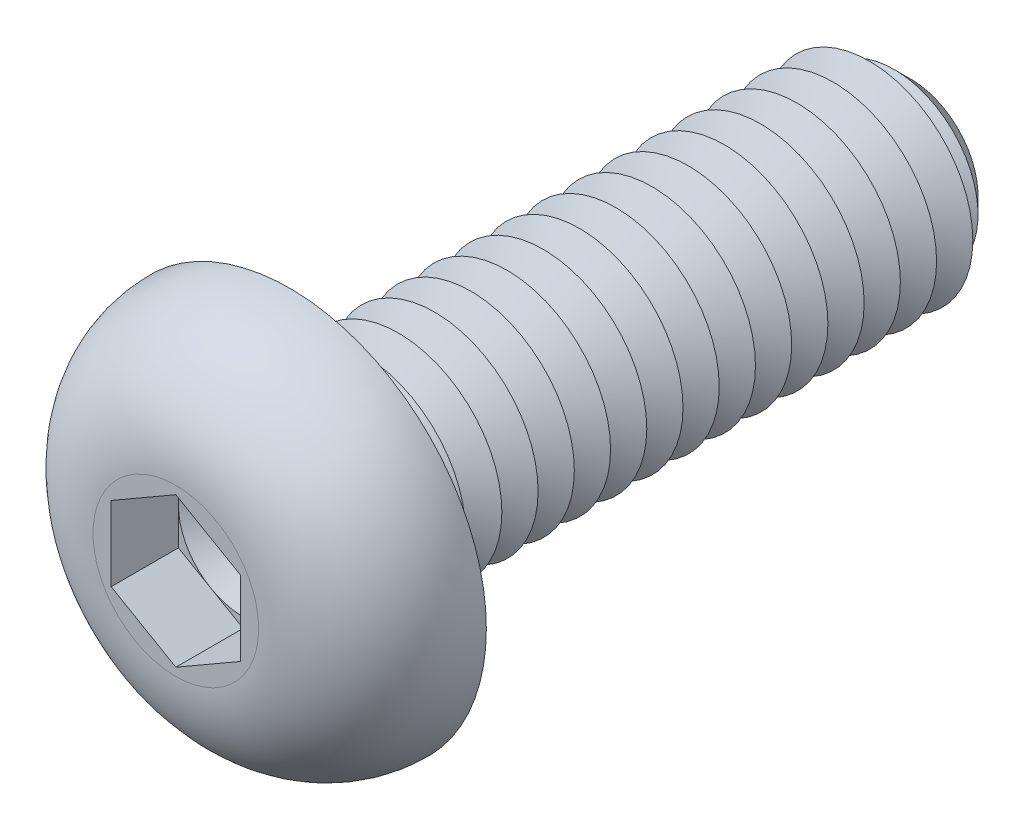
from build123d import *

# Parameters (mm, degrees)
CUT_EXTRUDE1_DEPTH  = 1.3
SKETCH4_R           = 2
BOSS_EXTRUDE1_DEPTH = 12
CHAMFER1_SIZE       = 0.7
LPATTERN1_COUNT     = 16
LPATTERN1_PITCH     = 0.7
FILLET2_R           = 0.3


with BuildPart() as part:
    # Sketch2 → Revolve1 (revolve)
    with BuildSketch(Plane(origin=(0, 0, 0), x_dir=(0, 0, -1), z_dir=(1, 0, 0)), mode=Mode.PRIVATE) as revolve1_sk:
        with BuildLine():
            Line((0, 0), (-2.2, 0))
            Line((-2.2, 0), (-2.2, 1.6))
            ThreePointArc((-2.2, 1.6), (-1.555634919, 3.155634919), (0, 3.8))
            Line((0, 3.8), (0, 0))
        make_face()
    revolve(revolve1_sk.sketch.rotate(Axis((0, 0, 47.934239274), (0, 0, -1)), 90), axis=Axis((0, 0, 47.934239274), (0, 0, -1)))

    # Sketch3 → Cut-Extrude1 (cut)
    with BuildSketch(Plane.XY.offset(2.2)):
        Polygon((0, 1.443375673), (-1.25, 0.721687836), (-1.25, -0.721687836), (0, -1.443375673), (1.25, -0.721687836), (1.25, 0.721687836), align=None)
    extrude(amount=-CUT_EXTRUDE1_DEPTH, mode=Mode.SUBTRACT)

    # Sketch4 → Boss-Extrude1 (add)
    with BuildSketch(Plane(origin=(0, 0, 0), x_dir=(-1, 0, 0), z_dir=(0, 0, -1))):
        with Locations(Location((0, 0, 0), (0, 0, 180))):
            Circle(SKETCH4_R)
    extrude(amount=BOSS_EXTRUDE1_DEPTH)

    # Chamfer1
    chamfer1_edges = [part.edges().sort_by_distance(p)[0] for p in [
        (-2, 0, -12),
    ]]
    chamfer(chamfer1_edges, length=CHAMFER1_SIZE)

    # Sketch5 → Cut-Revolve1 (revolve, cut)
    with BuildSketch(Plane(origin=(0, 0, 0), x_dir=(0, 0, -1), z_dir=(1, 0, 0)), mode=Mode.PRIVATE) as cut_revolve1_sk:
        Polygon((0.7, 2), (1.4, 2), (1.05, 1.393782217), align=None)
    cut_revolve1 = revolve(cut_revolve1_sk.sketch.rotate(Axis((0, 0, 47.934239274), (0, 0, -1)), 90), axis=Axis((0, 0, 47.934239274), (0, 0, -1)), mode=Mode.SUBTRACT)

    # LPattern1: Cut-Revolve1 ×16
    with Locations(*[(0, 0, -i * LPATTERN1_PITCH) for i in range(1, LPATTERN1_COUNT)]):
        add(cut_revolve1, mode=Mode.SUBTRACT)

    # Fillet2
    fillet2_edges = [part.edges().sort_by_distance(p)[0] for p in [
        (-2, 0, 0),
    ]]
    fillet(fillet2_edges, radius=FILLET2_R)

    # Cut-Extrude2 cone 1 section (on through the dimple's axis) → Cut-Extrude2 (revolve, cut)
    with BuildSketch(Plane(origin=(0, 0, 0.9), x_dir=(0, -1, 0), z_dir=(1, 0, 0))):
        Polygon((0, 0), (1.25, 0), (0, 0.721687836), align=None)
    revolve(axis=Axis((0, 0, 0.9), (0, 0, -1)), mode=Mode.SUBTRACT)


solid = part.part
